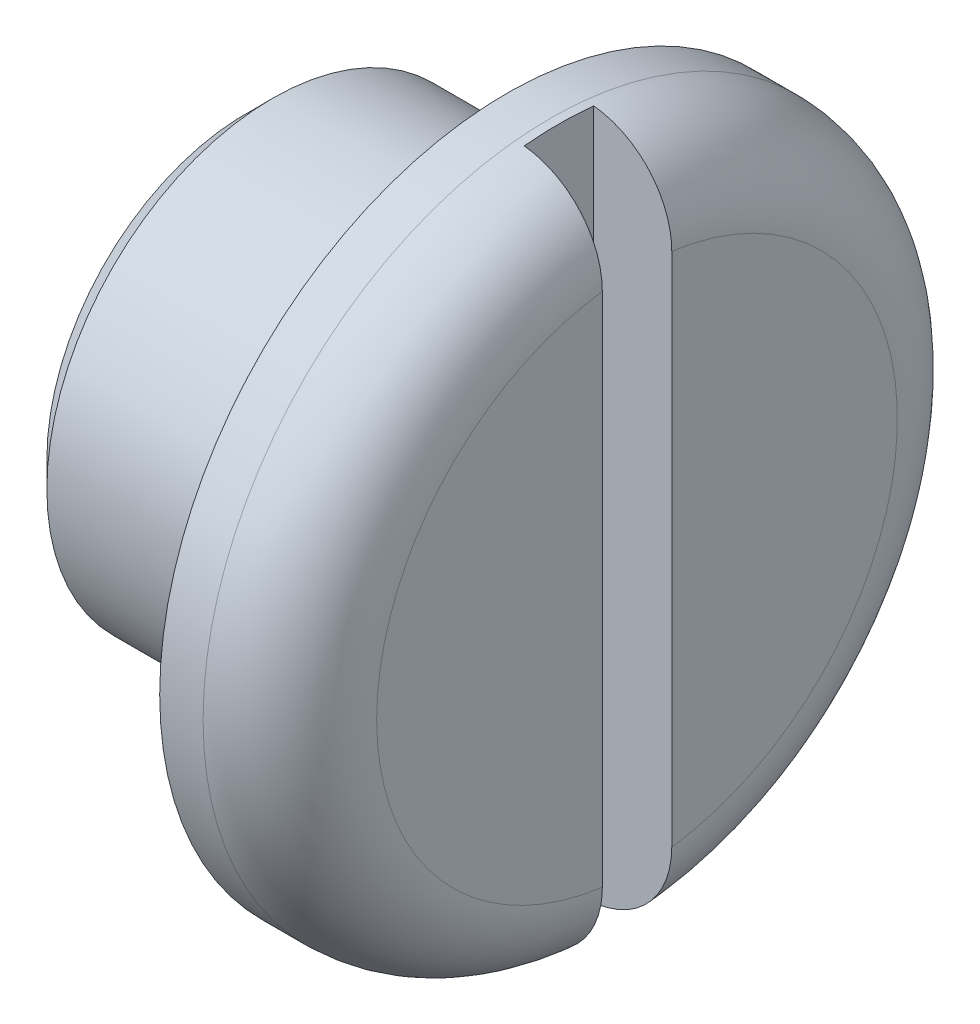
ISO-10303-21;
HEADER;
FILE_DESCRIPTION(('STEP AP214'),'2;1');
FILE_NAME('part.step','',(''),(''),'','','');
FILE_SCHEMA(('AUTOMOTIVE_DESIGN { 1 0 10303 214 1 1 1 1 }'));
ENDSEC;
DATA;
#1=APPLICATION_CONTEXT('core data for automotive mechanical design processes');
#2=APPLICATION_PROTOCOL_DEFINITION('international standard','automotive_design',2000,#1);
#3=PRODUCT_CONTEXT('',#1,'mechanical');
#4=PRODUCT('Part','Part','',(#3));
#5=PRODUCT_RELATED_PRODUCT_CATEGORY('part','',(#4));
#6=PRODUCT_DEFINITION_FORMATION('','',#4);
#7=PRODUCT_DEFINITION_CONTEXT('part definition',#1,'design');
#8=PRODUCT_DEFINITION('design','',#6,#7);
#9=PRODUCT_DEFINITION_SHAPE('','',#8);
#10=(LENGTH_UNIT() NAMED_UNIT(*) SI_UNIT(.MILLI.,.METRE.));
#11=(NAMED_UNIT(*) PLANE_ANGLE_UNIT() SI_UNIT($,.RADIAN.));
#12=(NAMED_UNIT(*) SI_UNIT($,.STERADIAN.) SOLID_ANGLE_UNIT());
#13=UNCERTAINTY_MEASURE_WITH_UNIT(LENGTH_MEASURE(1.E-05),#10,'distance_accuracy_value','');
#14=(GEOMETRIC_REPRESENTATION_CONTEXT(3) GLOBAL_UNCERTAINTY_ASSIGNED_CONTEXT((#13)) GLOBAL_UNIT_ASSIGNED_CONTEXT((#10,
#11,#12)) REPRESENTATION_CONTEXT('',''));
#15=CARTESIAN_POINT('',(0.,0.,0.));
#16=DIRECTION('',(0.,0.,1.));
#17=DIRECTION('',(1.,0.,0.));
#18=AXIS2_PLACEMENT_3D('',#15,#16,#17);
#19=CARTESIAN_POINT('',(2.25,0.,0.));
#20=DIRECTION('',(-1.,0.,0.));
#21=DIRECTION('',(0.,0.,1.));
#22=AXIS2_PLACEMENT_3D('',#19,#20,#21);
#23=PLANE('',#22);
#24=CARTESIAN_POINT('',(2.25,0.,0.));
#25=DIRECTION('',(-1.,0.,0.));
#26=DIRECTION('',(0.,0.,1.));
#27=AXIS2_PLACEMENT_3D('',#24,#25,#26);
#28=CIRCLE('',#27,1.5);
#29=CARTESIAN_POINT('',(2.25,-1.48660687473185,0.199999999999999));
#30=VERTEX_POINT('',#29);
#31=CARTESIAN_POINT('',(2.25,1.48660687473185,0.2));
#32=VERTEX_POINT('',#31);
#33=EDGE_CURVE('E82',#30,#32,#28,.T.);
#34=ORIENTED_EDGE('',*,*,#33,.F.);
#35=DIRECTION('',(0.,-1.,0.));
#36=VECTOR('',#35,1.);
#37=CARTESIAN_POINT('',(2.25,2.55009374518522,0.2));
#38=LINE('',#37,#36);
#39=EDGE_CURVE('E74',#32,#30,#38,.T.);
#40=ORIENTED_EDGE('',*,*,#39,.F.);
#41=EDGE_LOOP('',(#34,#40));
#42=FACE_BOUND('',#41,.T.);
#43=ADVANCED_FACE('F30',(#42),#23,.F.);
#44=CARTESIAN_POINT('',(0.,1.3,0.));
#45=DIRECTION('',(1.,0.,0.));
#46=DIRECTION('',(0.,0.,-1.));
#47=AXIS2_PLACEMENT_3D('',#44,#45,#46);
#48=PLANE('',#47);
#49=CARTESIAN_POINT('',(0.,0.,0.));
#50=DIRECTION('',(1.,0.,0.));
#51=DIRECTION('',(0.,0.,-1.));
#52=AXIS2_PLACEMENT_3D('',#49,#50,#51);
#53=CIRCLE('',#52,1.15);
#54=CARTESIAN_POINT('',(0.,0.,-1.15));
#55=VERTEX_POINT('',#54);
#56=EDGE_CURVE('E38',#55,#55,#53,.F.);
#57=ORIENTED_EDGE('',*,*,#56,.T.);
#58=EDGE_LOOP('',(#57));
#59=FACE_BOUND('',#58,.T.);
#60=ADVANCED_FACE('F130',(#59),#48,.F.);
#61=CARTESIAN_POINT('',(2.25,1.48660687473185,-0.2));
#62=VERTEX_POINT('',#61);
#63=CARTESIAN_POINT('',(2.25,-1.48660687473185,-0.2));
#64=VERTEX_POINT('',#63);
#65=EDGE_CURVE('E89',#62,#64,#28,.T.);
#66=ORIENTED_EDGE('',*,*,#65,.F.);
#67=DIRECTION('',(0.,1.,0.));
#68=VECTOR('',#67,1.);
#69=CARTESIAN_POINT('',(2.25,2.55009374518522,-0.2));
#70=LINE('',#69,#68);
#71=EDGE_CURVE('E83',#64,#62,#70,.T.);
#72=ORIENTED_EDGE('',*,*,#71,.F.);
#73=EDGE_LOOP('',(#66,#72));
#74=FACE_BOUND('',#73,.T.);
#75=ADVANCED_FACE('F139',(#74),#23,.F.);
#76=CARTESIAN_POINT('',(1.75,0.,0.));
#77=DIRECTION('',(-1.,0.,0.));
#78=DIRECTION('',(0.,0.,1.));
#79=AXIS2_PLACEMENT_3D('',#76,#77,#78);
#80=TOROIDAL_SURFACE('',#79,1.5,0.5);
#81=ORIENTED_EDGE('',*,*,#33,.T.);
#82=CARTESIAN_POINT('',(1.95508412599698,1.02465881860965,0.2));
#83=CARTESIAN_POINT('',(1.98079742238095,1.03644283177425,0.2));
#84=CARTESIAN_POINT('',(2.00552257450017,1.05043738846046,0.2));
#85=CARTESIAN_POINT('',(2.05228267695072,1.08240627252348,0.2));
#86=CARTESIAN_POINT('',(2.07431374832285,1.10038623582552,0.2));
#87=CARTESIAN_POINT('',(2.11503722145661,1.13975440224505,0.2));
#88=CARTESIAN_POINT('',(2.13373343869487,1.16113865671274,0.2));
#89=CARTESIAN_POINT('',(2.16730995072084,1.20670672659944,0.2));
#90=CARTESIAN_POINT('',(2.18219125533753,1.23088979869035,0.2));
#91=CARTESIAN_POINT('',(2.20788221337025,1.28165198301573,0.2));
#92=CARTESIAN_POINT('',(2.21864729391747,1.30825366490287,0.2));
#93=CARTESIAN_POINT('',(2.23558110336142,1.36288373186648,0.2));
#94=CARTESIAN_POINT('',(2.24174948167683,1.39091222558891,0.2));
#95=CARTESIAN_POINT('',(2.2493239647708,1.44772672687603,0.2));
#96=CARTESIAN_POINT('',(2.25070991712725,1.47651542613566,0.2));
#97=CARTESIAN_POINT('',(2.24860947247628,1.53391501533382,0.2));
#98=CARTESIAN_POINT('',(2.24512314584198,1.56252590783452,0.2));
#99=CARTESIAN_POINT('',(2.23338393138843,1.61863795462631,0.2));
#100=CARTESIAN_POINT('',(2.22514946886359,1.64614296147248,0.2));
#101=CARTESIAN_POINT('',(2.20414686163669,1.69936420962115,0.2));
#102=CARTESIAN_POINT('',(2.19137888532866,1.72508051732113,0.2));
#103=CARTESIAN_POINT('',(2.16176844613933,1.77379932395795,0.2));
#104=CARTESIAN_POINT('',(2.14495552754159,1.79681977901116,0.2));
#105=CARTESIAN_POINT('',(2.10767867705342,1.8396861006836,0.2));
#106=CARTESIAN_POINT('',(2.08721487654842,1.85953208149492,0.2));
#107=CARTESIAN_POINT('',(2.04337032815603,1.89534243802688,0.2));
#108=CARTESIAN_POINT('',(2.02001068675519,1.9113326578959,0.2));
#109=CARTESIAN_POINT('',(1.97092752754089,1.9391408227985,0.2));
#110=CARTESIAN_POINT('',(1.94520408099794,1.95095889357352,0.2));
#111=CARTESIAN_POINT('',(1.89226479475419,1.97002758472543,0.2));
#112=CARTESIAN_POINT('',(1.86505720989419,1.97730112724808,0.2));
#113=CARTESIAN_POINT('',(1.80980589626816,1.98716345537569,0.2));
#114=CARTESIAN_POINT('',(1.7817621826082,1.98975232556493,0.2));
#115=CARTESIAN_POINT('',(1.72571525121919,1.9901693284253,0.2));
#116=CARTESIAN_POINT('',(1.69771212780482,1.98801026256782,0.2));
#117=CARTESIAN_POINT('',(1.64246631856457,1.9790204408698,0.2));
#118=CARTESIAN_POINT('',(1.6152236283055,1.97218971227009,0.2));
#119=CARTESIAN_POINT('',(1.56227477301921,1.95405610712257,0.2));
#120=CARTESIAN_POINT('',(1.53656837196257,1.94275391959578,0.2));
#121=CARTESIAN_POINT('',(1.48741190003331,1.91600401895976,0.2));
#122=CARTESIAN_POINT('',(1.46396184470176,1.90055627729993,0.2));
#123=CARTESIAN_POINT('',(1.41992125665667,1.86591798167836,0.2));
#124=CARTESIAN_POINT('',(1.39933765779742,1.84671861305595,0.2));
#125=CARTESIAN_POINT('',(1.36166757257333,1.8051512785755,0.2));
#126=CARTESIAN_POINT('',(1.34458115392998,1.78278325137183,0.2));
#127=CARTESIAN_POINT('',(1.3143002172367,1.73540145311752,0.2));
#128=CARTESIAN_POINT('',(1.30112466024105,1.71037556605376,0.2));
#129=CARTESIAN_POINT('',(1.27913065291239,1.65847773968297,0.2));
#130=CARTESIAN_POINT('',(1.27031234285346,1.63160574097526,0.2));
#131=CARTESIAN_POINT('',(1.25721882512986,1.57658732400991,0.2));
#132=CARTESIAN_POINT('',(1.25297433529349,1.54843359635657,0.2));
#133=CARTESIAN_POINT('',(1.24923571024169,1.49181266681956,0.2));
#134=CARTESIAN_POINT('',(1.2497417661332,1.46334545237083,0.2));
#135=CARTESIAN_POINT('',(1.25549714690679,1.40668706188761,0.2));
#136=CARTESIAN_POINT('',(1.26078063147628,1.37849935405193,0.2));
#137=CARTESIAN_POINT('',(1.27598165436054,1.32340181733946,0.2));
#138=CARTESIAN_POINT('',(1.28589939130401,1.29649204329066,0.2));
#139=CARTESIAN_POINT('',(1.31014824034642,1.24458471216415,0.2));
#140=CARTESIAN_POINT('',(1.32449990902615,1.21959675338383,0.2));
#141=CARTESIAN_POINT('',(1.35720452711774,1.17239118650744,0.2));
#142=CARTESIAN_POINT('',(1.37555752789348,1.15017361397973,0.2));
#143=CARTESIAN_POINT('',(1.41570765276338,1.10921679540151,0.2));
#144=CARTESIAN_POINT('',(1.43749572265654,1.09046867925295,0.2));
#145=CARTESIAN_POINT('',(1.48394504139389,1.05695466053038,0.2));
#146=CARTESIAN_POINT('',(1.50860596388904,1.0421883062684,0.2));
#147=CARTESIAN_POINT('',(1.55975595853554,1.01727933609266,0.2));
#148=CARTESIAN_POINT('',(1.58621629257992,1.00707773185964,0.2));
#149=CARTESIAN_POINT('',(1.64049956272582,0.991350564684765,0.2));
#150=CARTESIAN_POINT('',(1.66832267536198,0.985825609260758,0.2));
#151=CARTESIAN_POINT('',(1.72401645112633,0.979697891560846,0.2));
#152=CARTESIAN_POINT('',(1.7518780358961,0.979011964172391,0.2));
#153=CARTESIAN_POINT('',(1.80729032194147,0.982367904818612,0.2));
#154=CARTESIAN_POINT('',(1.8348413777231,0.986403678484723,0.2));
#155=CARTESIAN_POINT('',(1.87786246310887,0.996472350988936,0.2));
#156=CARTESIAN_POINT('',(1.89369337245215,1.00102783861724,0.2));
#157=CARTESIAN_POINT('',(1.92482243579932,1.0116923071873,0.2));
#158=CARTESIAN_POINT('',(1.94012059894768,1.01780126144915,0.2));
#159=CARTESIAN_POINT('',(1.95508412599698,1.02465881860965,0.2));
#160=B_SPLINE_CURVE_WITH_KNOTS('',3,(#82,#83,#84,#85,#86,#87,#88,#89,#90,#91,#92,#93,#94,#95,
#96,#97,#98,#99,#100,#101,#102,#103,#104,#105,#106,#107,#108,#109,#110,#111,#112,#113,#114,#115,
#116,#117,#118,#119,#120,#121,#122,#123,#124,#125,#126,#127,#128,#129,#130,#131,#132,#133,#134,
#135,#136,#137,#138,#139,#140,#141,#142,#143,#144,#145,#146,#147,#148,#149,#150,#151,#152,#153,
#154,#155,#156,#157,#158,#159),.UNSPECIFIED.,.T.,.F.,(4,2,2,2,2,2,2,2,2,2,2,2,2,2,2,2,2,2,2,2,2,
2,2,2,2,2,2,2,2,2,2,2,2,2,2,2,2,2,4),(0.,0.0847933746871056,0.169707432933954,0.254523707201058,
0.339317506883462,0.425005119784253,0.510699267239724,0.596754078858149,0.682807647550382,
0.768529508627,0.854248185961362,0.939358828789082,1.02446640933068,1.1089866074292,
1.19350425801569,1.27759209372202,1.3616784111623,1.44553829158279,1.52939768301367,
1.61324415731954,1.69709120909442,1.78113768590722,1.86518579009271,1.94963496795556,
2.03408686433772,2.11910247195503,2.20412149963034,2.28975328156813,2.3753887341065,
2.46142732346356,2.5474670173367,2.63328360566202,2.71909045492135,2.80375395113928,
2.88842844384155,2.97164406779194,3.05475240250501,3.10409768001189,3.15344211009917),.UNSPECIFIED.);
#161=CARTESIAN_POINT('',(1.8,1.98745595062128,0.2));
#162=VERTEX_POINT('',#161);
#163=EDGE_CURVE('E71',#32,#162,#160,.T.);
#164=ORIENTED_EDGE('',*,*,#163,.T.);
#165=CARTESIAN_POINT('',(1.8,0.,0.));
#166=DIRECTION('',(1.,0.,0.));
#167=DIRECTION('',(0.,0.,-1.));
#168=AXIS2_PLACEMENT_3D('',#165,#166,#167);
#169=CIRCLE('',#168,1.99749371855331);
#170=CARTESIAN_POINT('',(1.8,1.98745595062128,-0.2));
#171=VERTEX_POINT('',#170);
#172=EDGE_CURVE('E101',#171,#162,#169,.T.);
#173=ORIENTED_EDGE('',*,*,#172,.F.);
#174=CARTESIAN_POINT('',(1.95508412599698,1.02465881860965,-0.2));
#175=CARTESIAN_POINT('',(1.92995993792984,1.01314751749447,-0.2));
#176=CARTESIAN_POINT('',(1.90385647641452,1.0037295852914,-0.2));
#177=CARTESIAN_POINT('',(1.85042057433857,0.989397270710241,-0.2));
#178=CARTESIAN_POINT('',(1.82308694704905,0.984487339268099,-0.2));
#179=CARTESIAN_POINT('',(1.76798328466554,0.97934548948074,-0.2));
#180=CARTESIAN_POINT('',(1.74021329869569,0.97911304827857,-0.2));
#181=CARTESIAN_POINT('',(1.68503865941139,0.983333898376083,-0.2));
#182=CARTESIAN_POINT('',(1.65763393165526,0.987786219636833,-0.2));
#183=CARTESIAN_POINT('',(1.60405275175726,1.00120266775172,-0.2));
#184=CARTESIAN_POINT('',(1.57787245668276,1.0101514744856,-0.2));
#185=CARTESIAN_POINT('',(1.52735886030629,1.0322672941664,-0.2));
#186=CARTESIAN_POINT('',(1.50302572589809,1.04543468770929,-0.2));
#187=CARTESIAN_POINT('',(1.45658391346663,1.07576576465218,-0.2));
#188=CARTESIAN_POINT('',(1.43450471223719,1.09297456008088,-0.2));
#189=CARTESIAN_POINT('',(1.39348462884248,1.13079539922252,-0.2));
#190=CARTESIAN_POINT('',(1.37454402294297,1.15140774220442,-0.2));
#191=CARTESIAN_POINT('',(1.33999303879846,1.19584488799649,-0.2));
#192=CARTESIAN_POINT('',(1.32444715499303,1.21971985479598,-0.2));
#193=CARTESIAN_POINT('',(1.29753567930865,1.26972004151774,-0.2));
#194=CARTESIAN_POINT('',(1.28617033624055,1.29584539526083,-0.2));
#195=CARTESIAN_POINT('',(1.26783773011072,1.34989790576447,-0.2));
#196=CARTESIAN_POINT('',(1.2609169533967,1.37784084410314,-0.2));
#197=CARTESIAN_POINT('',(1.25186299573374,1.43449243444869,-0.2));
#198=CARTESIAN_POINT('',(1.2497298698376,1.46320109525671,-0.2));
#199=CARTESIAN_POINT('',(1.25032493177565,1.52057565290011,-0.2));
#200=CARTESIAN_POINT('',(1.2530542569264,1.54924153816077,-0.2));
#201=CARTESIAN_POINT('',(1.2633154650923,1.6057009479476,-0.2));
#202=CARTESIAN_POINT('',(1.27084722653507,1.6334944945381,-0.2));
#203=CARTESIAN_POINT('',(1.29045672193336,1.68724718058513,-0.2));
#204=CARTESIAN_POINT('',(1.30250795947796,1.71321598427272,-0.2));
#205=CARTESIAN_POINT('',(1.33083031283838,1.76274069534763,-0.2));
#206=CARTESIAN_POINT('',(1.34710127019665,1.78629669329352,-0.2));
#207=CARTESIAN_POINT('',(1.3832725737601,1.83014416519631,-0.2));
#208=CARTESIAN_POINT('',(1.40314551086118,1.85045825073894,-0.2));
#209=CARTESIAN_POINT('',(1.44603867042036,1.88743589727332,-0.2));
#210=CARTESIAN_POINT('',(1.46905878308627,1.90409958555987,-0.2));
#211=CARTESIAN_POINT('',(1.51743686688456,1.93319573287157,-0.2));
#212=CARTESIAN_POINT('',(1.5427793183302,1.94565399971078,-0.2));
#213=CARTESIAN_POINT('',(1.59520204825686,1.9661189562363,-0.2));
#214=CARTESIAN_POINT('',(1.62228228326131,1.97412575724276,-0.2));
#215=CARTESIAN_POINT('',(1.67729208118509,1.98543016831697,-0.2));
#216=CARTESIAN_POINT('',(1.70521769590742,1.98874699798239,-0.2));
#217=CARTESIAN_POINT('',(1.76122882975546,1.9906368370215,-0.2));
#218=CARTESIAN_POINT('',(1.78931434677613,1.98920990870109,-0.2));
#219=CARTESIAN_POINT('',(1.84480007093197,1.98166007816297,-0.2));
#220=CARTESIAN_POINT('',(1.87220131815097,1.97554481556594,-0.2));
#221=CARTESIAN_POINT('',(1.92558957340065,1.95880485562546,-0.2));
#222=CARTESIAN_POINT('',(1.9515765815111,1.94818015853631,-0.2));
#223=CARTESIAN_POINT('',(2.0014265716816,1.92271658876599,-0.2));
#224=CARTESIAN_POINT('',(2.02528757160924,1.90787383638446,-0.2));
#225=CARTESIAN_POINT('',(2.07018972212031,1.87440584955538,-0.2));
#226=CARTESIAN_POINT('',(2.09123084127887,1.85578057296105,-0.2));
#227=CARTESIAN_POINT('',(2.12997597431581,1.81521106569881,-0.2));
#228=CARTESIAN_POINT('',(2.14766833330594,1.7932557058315,-0.2));
#229=CARTESIAN_POINT('',(2.17914015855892,1.74670035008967,-0.2));
#230=CARTESIAN_POINT('',(2.19291952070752,1.7221002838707,-0.2));
#231=CARTESIAN_POINT('',(2.21626034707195,1.67080611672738,-0.2));
#232=CARTESIAN_POINT('',(2.22579745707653,1.64410093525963,-0.2));
#233=CARTESIAN_POINT('',(2.24028803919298,1.58947499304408,-0.2));
#234=CARTESIAN_POINT('',(2.24524133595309,1.56155418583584,-0.2));
#235=CARTESIAN_POINT('',(2.25046136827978,1.50507615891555,-0.2));
#236=CARTESIAN_POINT('',(2.25069428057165,1.47651581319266,-0.2));
#237=CARTESIAN_POINT('',(2.24639552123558,1.41975695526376,-0.2));
#238=CARTESIAN_POINT('',(2.24186382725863,1.39155844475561,-0.2));
#239=CARTESIAN_POINT('',(2.22812710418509,1.33612750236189,-0.2));
#240=CARTESIAN_POINT('',(2.21889171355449,1.30890259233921,-0.2));
#241=CARTESIAN_POINT('',(2.19598935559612,1.25637553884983,-0.2));
#242=CARTESIAN_POINT('',(2.1823211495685,1.23107393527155,-0.2));
#243=CARTESIAN_POINT('',(2.15089086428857,1.18305857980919,-0.2));
#244=CARTESIAN_POINT('',(2.13311770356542,1.16035208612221,-0.2));
#245=CARTESIAN_POINT('',(2.09399922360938,1.11829205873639,-0.2));
#246=CARTESIAN_POINT('',(2.07265828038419,1.09893447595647,-0.2));
#247=CARTESIAN_POINT('',(2.0351574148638,1.07035298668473,-0.2));
#248=CARTESIAN_POINT('',(2.01986171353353,1.05997625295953,-0.2));
#249=CARTESIAN_POINT('',(1.98821774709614,1.04097449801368,-0.2));
#250=CARTESIAN_POINT('',(1.97186948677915,1.03234946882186,-0.2));
#251=CARTESIAN_POINT('',(1.95508412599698,1.02465881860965,-0.2));
#252=B_SPLINE_CURVE_WITH_KNOTS('',3,(#174,#175,#176,#177,#178,#179,#180,#181,#182,#183,#184,
#185,#186,#187,#188,#189,#190,#191,#192,#193,#194,#195,#196,#197,#198,#199,#200,#201,#202,#203,
#204,#205,#206,#207,#208,#209,#210,#211,#212,#213,#214,#215,#216,#217,#218,#219,#220,#221,#222,
#223,#224,#225,#226,#227,#228,#229,#230,#231,#232,#233,#234,#235,#236,#237,#238,#239,#240,#241,
#242,#243,#244,#245,#246,#247,#248,#249,#250,#251),.UNSPECIFIED.,.T.,.F.,(4,2,2,2,2,2,2,2,2,2,2,
2,2,2,2,2,2,2,2,2,2,2,2,2,2,2,2,2,2,2,2,2,2,2,2,2,2,2,4),(0.,0.082840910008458,
0.165763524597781,0.248676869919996,0.331573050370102,0.414188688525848,0.496811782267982,
0.580405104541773,0.664005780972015,0.749078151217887,0.834155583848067,0.920108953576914,
1.00606331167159,1.09203777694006,1.17801006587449,1.26348600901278,1.34895874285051,
1.43380647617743,1.51865125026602,1.60296545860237,1.68727755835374,1.77124313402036,
1.85520760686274,1.93903554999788,2.02286348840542,2.10676878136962,2.19067500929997,
2.27486809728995,2.3590634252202,2.44373605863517,2.52841193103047,2.6136943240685,
2.69897711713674,2.78481750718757,2.8706819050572,2.95678086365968,3.0427749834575,
3.09812088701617,3.15346653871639),.UNSPECIFIED.);
#253=EDGE_CURVE('E53',#171,#62,#252,.T.);
#254=ORIENTED_EDGE('',*,*,#253,.T.);
#255=ORIENTED_EDGE('',*,*,#65,.T.);
#256=CARTESIAN_POINT('',(2.04041542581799,-1.89649552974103,-0.2));
#257=CARTESIAN_POINT('',(2.01767005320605,-1.91281353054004,-0.2));
#258=CARTESIAN_POINT('',(1.99353402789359,-1.92722712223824,-0.200000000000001));
#259=CARTESIAN_POINT('',(1.94316573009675,-1.95181106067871,-0.200000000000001));
#260=CARTESIAN_POINT('',(1.91693107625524,-1.96197650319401,-0.200000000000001));
#261=CARTESIAN_POINT('',(1.8631333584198,-1.97775078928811,-0.200000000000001));
#262=CARTESIAN_POINT('',(1.83557077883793,-1.98336128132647,-0.200000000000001));
#263=CARTESIAN_POINT('',(1.77990179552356,-1.98986537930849,-0.200000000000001));
#264=CARTESIAN_POINT('',(1.75179552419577,-1.9907601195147,-0.200000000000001));
#265=CARTESIAN_POINT('',(1.6958732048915,-1.98781250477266,-0.200000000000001));
#266=CARTESIAN_POINT('',(1.66805679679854,-1.98397698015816,-0.200000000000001));
#267=CARTESIAN_POINT('',(1.61346167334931,-1.971691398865,-0.200000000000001));
#268=CARTESIAN_POINT('',(1.58668299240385,-1.96324118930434,-0.200000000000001));
#269=CARTESIAN_POINT('',(1.53491438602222,-1.94196790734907,-0.200000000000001));
#270=CARTESIAN_POINT('',(1.50992496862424,-1.92914359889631,-0.2));
#271=CARTESIAN_POINT('',(1.46244600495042,-1.89949284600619,-0.2));
#272=CARTESIAN_POINT('',(1.43995647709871,-1.88266637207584,-0.2));
#273=CARTESIAN_POINT('',(1.39804482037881,-1.84544141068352,-0.2));
#274=CARTESIAN_POINT('',(1.37863152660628,-1.82503297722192,-0.2));
#275=CARTESIAN_POINT('',(1.3434859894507,-1.78126116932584,-0.2));
#276=CARTESIAN_POINT('',(1.32775381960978,-1.75789773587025,-0.2));
#277=CARTESIAN_POINT('',(1.3003272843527,-1.70875187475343,-0.2));
#278=CARTESIAN_POINT('',(1.28865418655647,-1.68295758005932,-0.2));
#279=CARTESIAN_POINT('',(1.26977097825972,-1.62978447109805,-0.2));
#280=CARTESIAN_POINT('',(1.26256102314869,-1.60240560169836,-0.2));
#281=CARTESIAN_POINT('',(1.25275473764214,-1.54663883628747,-0.2));
#282=CARTESIAN_POINT('',(1.25019061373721,-1.51824527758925,-0.2));
#283=CARTESIAN_POINT('',(1.24982987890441,-1.46142796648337,-0.2));
#284=CARTESIAN_POINT('',(1.25203346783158,-1.43300421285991,-0.2));
#285=CARTESIAN_POINT('',(1.26116681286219,-1.37672054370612,-0.2));
#286=CARTESIAN_POINT('',(1.26812975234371,-1.34886601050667,-0.2));
#287=CARTESIAN_POINT('',(1.28661463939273,-1.29471236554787,-0.2));
#288=CARTESIAN_POINT('',(1.29813676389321,-1.26841331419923,-0.2));
#289=CARTESIAN_POINT('',(1.32547184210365,-1.21801801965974,-0.2));
#290=CARTESIAN_POINT('',(1.34130089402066,-1.19393050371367,-0.2));
#291=CARTESIAN_POINT('',(1.37679456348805,-1.1487679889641,-0.2));
#292=CARTESIAN_POINT('',(1.39645918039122,-1.12769298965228,-0.2));
#293=CARTESIAN_POINT('',(1.4389870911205,-1.08927011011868,-0.2));
#294=CARTESIAN_POINT('',(1.46183588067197,-1.07190618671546,-0.2));
#295=CARTESIAN_POINT('',(1.5101603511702,-1.04132826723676,-0.2));
#296=CARTESIAN_POINT('',(1.53563579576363,-1.02811389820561,-0.2));
#297=CARTESIAN_POINT('',(1.58808951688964,-1.00642979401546,-0.2));
#298=CARTESIAN_POINT('',(1.61503986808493,-0.997892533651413,-0.2));
#299=CARTESIAN_POINT('',(1.67000277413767,-0.985552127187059,-0.2));
#300=CARTESIAN_POINT('',(1.69801519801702,-0.981748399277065,-0.2));
#301=CARTESIAN_POINT('',(1.75379899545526,-0.979028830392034,-0.2));
#302=CARTESIAN_POINT('',(1.78156641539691,-0.980031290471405,-0.2));
#303=CARTESIAN_POINT('',(1.83653378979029,-0.986702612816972,-0.2));
#304=CARTESIAN_POINT('',(1.86373375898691,-0.992371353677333,-0.2));
#305=CARTESIAN_POINT('',(1.91670532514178,-1.00815931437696,-0.2));
#306=CARTESIAN_POINT('',(1.94248151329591,-1.0182631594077,-0.2));
#307=CARTESIAN_POINT('',(1.99200462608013,-1.04259847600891,-0.2));
#308=CARTESIAN_POINT('',(2.01575141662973,-1.05683022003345,-0.2));
#309=CARTESIAN_POINT('',(2.06088955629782,-1.08921237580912,-0.2));
#310=CARTESIAN_POINT('',(2.08224492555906,-1.1074129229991,-0.2));
#311=CARTESIAN_POINT('',(2.12166254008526,-1.14708572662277,-0.2));
#312=CARTESIAN_POINT('',(2.13972448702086,-1.1685582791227,-0.2));
#313=CARTESIAN_POINT('',(2.17236159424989,-1.21456767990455,-0.2));
#314=CARTESIAN_POINT('',(2.1868714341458,-1.23915088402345,-0.2));
#315=CARTESIAN_POINT('',(2.21160109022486,-1.29038832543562,-0.2));
#316=CARTESIAN_POINT('',(2.22182066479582,-1.31704267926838,-0.2));
#317=CARTESIAN_POINT('',(2.2377569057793,-1.37192451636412,-0.2));
#318=CARTESIAN_POINT('',(2.24343260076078,-1.40016390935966,-0.2));
#319=CARTESIAN_POINT('',(2.24995836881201,-1.45719433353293,-0.2));
#320=CARTESIAN_POINT('',(2.25080860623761,-1.4859853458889,-0.2));
#321=CARTESIAN_POINT('',(2.24764715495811,-1.54327228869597,-0.2));
#322=CARTESIAN_POINT('',(2.24364010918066,-1.57176847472,-0.2));
#323=CARTESIAN_POINT('',(2.23086670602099,-1.62768208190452,-0.2));
#324=CARTESIAN_POINT('',(2.22209929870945,-1.65509926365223,-0.2));
#325=CARTESIAN_POINT('',(2.20010622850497,-1.70789608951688,-0.2));
#326=CARTESIAN_POINT('',(2.18690635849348,-1.73328649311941,-0.2));
#327=CARTESIAN_POINT('',(2.15640887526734,-1.78144461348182,-0.2));
#328=CARTESIAN_POINT('',(2.13911638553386,-1.80421555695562,-0.2));
#329=CARTESIAN_POINT('',(2.10807866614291,-1.83857773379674,-0.2));
#330=CARTESIAN_POINT('',(2.09542069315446,-1.85116810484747,-0.2));
#331=CARTESIAN_POINT('',(2.06883513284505,-1.87492852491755,-0.2));
#332=CARTESIAN_POINT('',(2.05490755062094,-1.88609857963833,-0.2));
#333=CARTESIAN_POINT('',(2.04041542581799,-1.89649552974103,-0.2));
#334=B_SPLINE_CURVE_WITH_KNOTS('',3,(#256,#257,#258,#259,#260,#261,#262,#263,#264,#265,#266,
#267,#268,#269,#270,#271,#272,#273,#274,#275,#276,#277,#278,#279,#280,#281,#282,#283,#284,#285,
#286,#287,#288,#289,#290,#291,#292,#293,#294,#295,#296,#297,#298,#299,#300,#301,#302,#303,#304,
#305,#306,#307,#308,#309,#310,#311,#312,#313,#314,#315,#316,#317,#318,#319,#320,#321,#322,#323,
#324,#325,#326,#327,#328,#329,#330,#331,#332,#333),.UNSPECIFIED.,.T.,.F.,(4,2,2,2,2,2,2,2,2,2,2,
2,2,2,2,2,2,2,2,2,2,2,2,2,2,2,2,2,2,2,2,2,2,2,2,2,2,2,4),(0.,0.0839152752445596,
0.16792715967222,0.251908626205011,0.335869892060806,0.419710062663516,0.503553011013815,
0.587419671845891,0.671286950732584,0.755390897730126,0.839496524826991,0.924036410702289,
1.00857923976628,1.09370593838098,1.17883620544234,1.26456615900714,1.3502994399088,
1.4363576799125,1.52241590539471,1.60809421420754,1.69376482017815,1.7781635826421,
1.86255197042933,1.94551100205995,2.0284678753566,2.11113941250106,2.19381640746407,
2.2776054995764,2.36140217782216,2.44664024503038,2.53188311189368,2.61788620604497,
2.70388637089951,2.78980439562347,2.87574137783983,2.96118670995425,3.04652563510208,
3.0999921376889,3.15345842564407),.UNSPECIFIED.);
#335=CARTESIAN_POINT('',(1.8,-1.98745595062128,-0.200000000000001));
#336=VERTEX_POINT('',#335);
#337=EDGE_CURVE('E100',#64,#336,#334,.T.);
#338=ORIENTED_EDGE('',*,*,#337,.T.);
#339=CARTESIAN_POINT('',(1.8,-1.98745595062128,0.199999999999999));
#340=VERTEX_POINT('',#339);
#341=EDGE_CURVE('E93',#340,#336,#169,.T.);
#342=ORIENTED_EDGE('',*,*,#341,.F.);
#343=CARTESIAN_POINT('',(2.04041542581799,-1.89649552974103,0.199999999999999));
#344=CARTESIAN_POINT('',(2.06331710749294,-1.88006227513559,0.199999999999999));
#345=CARTESIAN_POINT('',(2.08484214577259,-1.86167399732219,0.199999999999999));
#346=CARTESIAN_POINT('',(2.124510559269,-1.82152311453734,0.199999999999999));
#347=CARTESIAN_POINT('',(2.14264962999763,-1.79975627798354,0.199999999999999));
#348=CARTESIAN_POINT('',(2.17500860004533,-1.7535040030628,0.199999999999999));
#349=CARTESIAN_POINT('',(2.1892314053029,-1.72902059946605,0.199999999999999));
#350=CARTESIAN_POINT('',(2.21338275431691,-1.67802959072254,0.199999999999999));
#351=CARTESIAN_POINT('',(2.22331235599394,-1.65152248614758,0.199999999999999));
#352=CARTESIAN_POINT('',(2.23865966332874,-1.59709231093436,0.199999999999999));
#353=CARTESIAN_POINT('',(2.24405495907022,-1.56916292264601,0.199999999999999));
#354=CARTESIAN_POINT('',(2.25011691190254,-1.51279468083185,0.199999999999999));
#355=CARTESIAN_POINT('',(2.25078319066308,-1.48435578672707,0.199999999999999));
#356=CARTESIAN_POINT('',(2.24737031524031,-1.42755701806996,0.199999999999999));
#357=CARTESIAN_POINT('',(2.24325671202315,-1.39919921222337,0.199999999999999));
#358=CARTESIAN_POINT('',(2.23035316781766,-1.34356786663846,0.199999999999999));
#359=CARTESIAN_POINT('',(2.22156303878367,-1.31629437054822,0.2));
#360=CARTESIAN_POINT('',(2.19949660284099,-1.26345750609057,0.2));
#361=CARTESIAN_POINT('',(2.18619697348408,-1.23790387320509,0.2));
#362=CARTESIAN_POINT('',(2.15549116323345,-1.18939448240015,0.2));
#363=CARTESIAN_POINT('',(2.13808491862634,-1.16643876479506,0.2));
#364=CARTESIAN_POINT('',(2.09967189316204,-1.12382659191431,0.2));
#365=CARTESIAN_POINT('',(2.07867033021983,-1.10416543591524,0.2));
#366=CARTESIAN_POINT('',(2.03362991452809,-1.06869821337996,0.2));
#367=CARTESIAN_POINT('',(2.00959124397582,-1.05289191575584,0.2));
#368=CARTESIAN_POINT('',(1.95945941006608,-1.02580084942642,0.2));
#369=CARTESIAN_POINT('',(1.93339430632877,-1.01446418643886,0.2));
#370=CARTESIAN_POINT('',(1.87970876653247,-0.996419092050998,0.2));
#371=CARTESIAN_POINT('',(1.85208853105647,-0.989710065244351,0.2));
#372=CARTESIAN_POINT('',(1.79660801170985,-0.981226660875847,0.2));
#373=CARTESIAN_POINT('',(1.76876090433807,-0.979365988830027,0.2));
#374=CARTESIAN_POINT('',(1.71315545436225,-0.980392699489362,0.2));
#375=CARTESIAN_POINT('',(1.68539710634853,-0.983279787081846,0.2));
#376=CARTESIAN_POINT('',(1.63101000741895,-0.993657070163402,0.2));
#377=CARTESIAN_POINT('',(1.6043734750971,-1.00110660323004,0.2));
#378=CARTESIAN_POINT('',(1.55271111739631,-1.02033132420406,0.2));
#379=CARTESIAN_POINT('',(1.5276853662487,-1.03210671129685,0.2));
#380=CARTESIAN_POINT('',(1.47969675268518,-1.05974727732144,0.2));
#381=CARTESIAN_POINT('',(1.45675512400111,-1.07564929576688,0.2));
#382=CARTESIAN_POINT('',(1.41380626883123,-1.11101614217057,0.2));
#383=CARTESIAN_POINT('',(1.39379930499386,-1.13048128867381,0.2));
#384=CARTESIAN_POINT('',(1.35691561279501,-1.17279583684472,0.2));
#385=CARTESIAN_POINT('',(1.34010074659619,-1.19569917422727,0.2));
#386=CARTESIAN_POINT('',(1.31049990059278,-1.24397639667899,0.2));
#387=CARTESIAN_POINT('',(1.29771419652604,-1.26935045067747,0.2));
#388=CARTESIAN_POINT('',(1.27639036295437,-1.32218145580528,0.2));
#389=CARTESIAN_POINT('',(1.26790512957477,-1.34965977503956,0.199999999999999));
#390=CARTESIAN_POINT('',(1.25565873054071,-1.40565022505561,0.199999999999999));
#391=CARTESIAN_POINT('',(1.25189765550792,-1.43416237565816,0.199999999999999));
#392=CARTESIAN_POINT('',(1.24921478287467,-1.49146415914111,0.199999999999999));
#393=CARTESIAN_POINT('',(1.25030140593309,-1.52025418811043,0.199999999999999));
#394=CARTESIAN_POINT('',(1.25731834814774,-1.57723827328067,0.199999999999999));
#395=CARTESIAN_POINT('',(1.26324856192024,-1.60543234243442,0.199999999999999));
#396=CARTESIAN_POINT('',(1.27975705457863,-1.66026829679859,0.199999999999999));
#397=CARTESIAN_POINT('',(1.29031141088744,-1.68691738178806,0.199999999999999));
#398=CARTESIAN_POINT('',(1.31577655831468,-1.73804625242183,0.199999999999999));
#399=CARTESIAN_POINT('',(1.33068719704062,-1.76252611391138,0.199999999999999));
#400=CARTESIAN_POINT('',(1.36432449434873,-1.80843147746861,0.199999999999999));
#401=CARTESIAN_POINT('',(1.38302254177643,-1.82987794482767,0.199999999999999));
#402=CARTESIAN_POINT('',(1.42377516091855,-1.86930155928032,0.199999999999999));
#403=CARTESIAN_POINT('',(1.44582961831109,-1.88727882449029,0.199999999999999));
#404=CARTESIAN_POINT('',(1.49251307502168,-1.91913169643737,0.199999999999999));
#405=CARTESIAN_POINT('',(1.51712435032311,-1.93303328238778,0.199999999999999));
#406=CARTESIAN_POINT('',(1.56833833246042,-1.95648502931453,0.199999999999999));
#407=CARTESIAN_POINT('',(1.59494090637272,-1.96603548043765,0.199999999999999));
#408=CARTESIAN_POINT('',(1.64925081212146,-1.9804727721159,0.199999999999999));
#409=CARTESIAN_POINT('',(1.67695248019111,-1.98538092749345,0.199999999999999));
#410=CARTESIAN_POINT('',(1.73279430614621,-1.9904670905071,0.199999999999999));
#411=CARTESIAN_POINT('',(1.76093456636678,-1.9906439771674,0.199999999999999));
#412=CARTESIAN_POINT('',(1.81679683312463,-1.98626485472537,0.199999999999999));
#413=CARTESIAN_POINT('',(1.84451942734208,-1.98171628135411,0.199999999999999));
#414=CARTESIAN_POINT('',(1.89878320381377,-1.96803135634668,0.199999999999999));
#415=CARTESIAN_POINT('',(1.92532578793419,-1.95890061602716,0.199999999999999));
#416=CARTESIAN_POINT('',(1.96665174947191,-1.94067478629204,0.199999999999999));
#417=CARTESIAN_POINT('',(1.98203700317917,-1.93291222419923,0.199999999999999));
#418=CARTESIAN_POINT('',(2.01192451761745,-1.91584141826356,0.199999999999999));
#419=CARTESIAN_POINT('',(2.02642677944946,-1.90653317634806,0.199999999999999));
#420=CARTESIAN_POINT('',(2.04041542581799,-1.89649552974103,0.199999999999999));
#421=B_SPLINE_CURVE_WITH_KNOTS('',3,(#343,#344,#345,#346,#347,#348,#349,#350,#351,#352,#353,
#354,#355,#356,#357,#358,#359,#360,#361,#362,#363,#364,#365,#366,#367,#368,#369,#370,#371,#372,
#373,#374,#375,#376,#377,#378,#379,#380,#381,#382,#383,#384,#385,#386,#387,#388,#389,#390,#391,
#392,#393,#394,#395,#396,#397,#398,#399,#400,#401,#402,#403,#404,#405,#406,#407,#408,#409,#410,
#411,#412,#413,#414,#415,#416,#417,#418,#419,#420),.UNSPECIFIED.,.T.,.F.,(4,2,2,2,2,2,2,2,2,2,2,
2,2,2,2,2,2,2,2,2,2,2,2,2,2,2,2,2,2,2,2,2,2,2,2,2,2,2,4),(0.,0.0844993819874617,
0.169105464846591,0.253648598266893,0.338170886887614,0.423108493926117,0.508052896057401,
0.593613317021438,0.67917717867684,0.76519048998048,0.85120513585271,0.937095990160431,
1.02298169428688,1.10783859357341,1.19268457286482,1.2760097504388,1.3593297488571,
1.4419177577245,1.52450956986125,1.60786570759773,1.69122930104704,1.77607253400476,
1.86092157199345,1.94679036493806,2.03266080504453,2.11868046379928,2.20469825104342,
2.29027619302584,2.3758511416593,2.46080224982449,2.54575046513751,2.63014480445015,
2.71453351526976,2.79853285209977,2.88255209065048,2.96643932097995,3.0502240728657,
3.10183746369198,3.15345079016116),.UNSPECIFIED.);
#422=EDGE_CURVE('E88',#340,#30,#421,.T.);
#423=ORIENTED_EDGE('',*,*,#422,.T.);
#424=EDGE_LOOP('',(#81,#164,#173,#254,#255,#338,#342,#423));
#425=FACE_BOUND('',#424,.T.);
#426=CARTESIAN_POINT('',(1.75,0.,0.));
#427=DIRECTION('',(-1.,0.,0.));
#428=DIRECTION('',(0.,0.,1.));
#429=AXIS2_PLACEMENT_3D('',#426,#427,#428);
#430=CIRCLE('',#429,2.);
#431=CARTESIAN_POINT('',(1.75,0.,2.));
#432=VERTEX_POINT('',#431);
#433=EDGE_CURVE('E90',#432,#432,#430,.T.);
#434=ORIENTED_EDGE('',*,*,#433,.F.);
#435=EDGE_LOOP('',(#434));
#436=FACE_BOUND('',#435,.T.);
#437=ADVANCED_FACE('F85',(#425,#436),#80,.T.);
#438=CARTESIAN_POINT('',(0.,0.,0.));
#439=DIRECTION('',(-1.,0.,0.));
#440=DIRECTION('',(0.,0.,1.));
#441=AXIS2_PLACEMENT_3D('',#438,#439,#440);
#442=CYLINDRICAL_SURFACE('',#441,2.);
#443=CARTESIAN_POINT('',(1.5,0.,0.));
#444=DIRECTION('',(-1.,0.,0.));
#445=DIRECTION('',(0.,0.,1.));
#446=AXIS2_PLACEMENT_3D('',#443,#444,#445);
#447=CIRCLE('',#446,2.);
#448=CARTESIAN_POINT('',(1.5,0.,2.));
#449=VERTEX_POINT('',#448);
#450=EDGE_CURVE('E95',#449,#449,#447,.T.);
#451=ORIENTED_EDGE('',*,*,#450,.F.);
#452=EDGE_LOOP('',(#451));
#453=FACE_BOUND('',#452,.T.);
#454=ORIENTED_EDGE('',*,*,#433,.T.);
#455=EDGE_LOOP('',(#454));
#456=FACE_BOUND('',#455,.T.);
#457=ADVANCED_FACE('F148',(#453,#456),#442,.T.);
#458=CARTESIAN_POINT('',(1.5,2.,0.));
#459=DIRECTION('',(1.,0.,0.));
#460=DIRECTION('',(0.,0.,-1.));
#461=AXIS2_PLACEMENT_3D('',#458,#459,#460);
#462=PLANE('',#461);
#463=CARTESIAN_POINT('',(1.5,0.,0.));
#464=DIRECTION('',(-1.,0.,0.));
#465=DIRECTION('',(0.,0.,1.));
#466=AXIS2_PLACEMENT_3D('',#463,#464,#465);
#467=CIRCLE('',#466,1.3);
#468=CARTESIAN_POINT('',(1.5,0.,1.3));
#469=VERTEX_POINT('',#468);
#470=EDGE_CURVE('E152',#469,#469,#467,.T.);
#471=ORIENTED_EDGE('',*,*,#470,.F.);
#472=EDGE_LOOP('',(#471));
#473=FACE_BOUND('',#472,.T.);
#474=ORIENTED_EDGE('',*,*,#450,.T.);
#475=EDGE_LOOP('',(#474));
#476=FACE_BOUND('',#475,.T.);
#477=ADVANCED_FACE('F161',(#473,#476),#462,.F.);
#478=CARTESIAN_POINT('',(0.,0.,0.));
#479=DIRECTION('',(-1.,0.,0.));
#480=DIRECTION('',(0.,0.,1.));
#481=AXIS2_PLACEMENT_3D('',#478,#479,#480);
#482=CYLINDRICAL_SURFACE('',#481,1.3);
#483=CARTESIAN_POINT('',(0.150000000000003,0.,0.));
#484=DIRECTION('',(1.,0.,0.));
#485=DIRECTION('',(0.,0.,-1.));
#486=AXIS2_PLACEMENT_3D('',#483,#484,#485);
#487=CIRCLE('',#486,1.3);
#488=CARTESIAN_POINT('',(0.150000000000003,0.,-1.3));
#489=VERTEX_POINT('',#488);
#490=EDGE_CURVE('E11',#489,#489,#487,.T.);
#491=ORIENTED_EDGE('',*,*,#490,.T.);
#492=EDGE_LOOP('',(#491));
#493=FACE_BOUND('',#492,.T.);
#494=ORIENTED_EDGE('',*,*,#470,.T.);
#495=EDGE_LOOP('',(#494));
#496=FACE_BOUND('',#495,.T.);
#497=ADVANCED_FACE('F169',(#493,#496),#482,.T.);
#498=CARTESIAN_POINT('',(1.8,2.55009374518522,0.2));
#499=DIRECTION('',(0.,0.,1.));
#500=DIRECTION('',(0.,-1.,0.));
#501=AXIS2_PLACEMENT_3D('',#498,#499,#500);
#502=PLANE('',#501);
#503=DIRECTION('',(0.,-1.,0.));
#504=VECTOR('',#503,1.);
#505=CARTESIAN_POINT('',(1.8,2.55009374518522,0.2));
#506=LINE('',#505,#504);
#507=EDGE_CURVE('E45',#162,#340,#506,.T.);
#508=ORIENTED_EDGE('',*,*,#507,.F.);
#509=ORIENTED_EDGE('',*,*,#163,.F.);
#510=ORIENTED_EDGE('',*,*,#39,.T.);
#511=ORIENTED_EDGE('',*,*,#422,.F.);
#512=EDGE_LOOP('',(#508,#509,#510,#511));
#513=FACE_BOUND('',#512,.T.);
#514=ADVANCED_FACE('F73',(#513),#502,.F.);
#515=CARTESIAN_POINT('',(1.8,2.55009374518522,-0.2));
#516=DIRECTION('',(0.,0.,-1.));
#517=DIRECTION('',(0.,1.,0.));
#518=AXIS2_PLACEMENT_3D('',#515,#516,#517);
#519=PLANE('',#518);
#520=ORIENTED_EDGE('',*,*,#71,.T.);
#521=ORIENTED_EDGE('',*,*,#253,.F.);
#522=DIRECTION('',(0.,1.,0.));
#523=VECTOR('',#522,1.);
#524=CARTESIAN_POINT('',(1.8,2.55009374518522,-0.2));
#525=LINE('',#524,#523);
#526=EDGE_CURVE('E151',#336,#171,#525,.T.);
#527=ORIENTED_EDGE('',*,*,#526,.F.);
#528=ORIENTED_EDGE('',*,*,#337,.F.);
#529=EDGE_LOOP('',(#520,#521,#527,#528));
#530=FACE_BOUND('',#529,.T.);
#531=ADVANCED_FACE('F115',(#530),#519,.F.);
#532=CARTESIAN_POINT('',(1.8,2.55009374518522,0.2));
#533=DIRECTION('',(1.,0.,0.));
#534=DIRECTION('',(0.,0.,-1.));
#535=AXIS2_PLACEMENT_3D('',#532,#533,#534);
#536=PLANE('',#535);
#537=ORIENTED_EDGE('',*,*,#172,.T.);
#538=ORIENTED_EDGE('',*,*,#507,.T.);
#539=ORIENTED_EDGE('',*,*,#341,.T.);
#540=ORIENTED_EDGE('',*,*,#526,.T.);
#541=EDGE_LOOP('',(#537,#538,#539,#540));
#542=FACE_BOUND('',#541,.T.);
#543=ADVANCED_FACE('F119',(#542),#536,.T.);
#544=CARTESIAN_POINT('',(0.,0.,0.));
#545=DIRECTION('',(1.,0.,0.));
#546=DIRECTION('',(0.,0.,-1.));
#547=AXIS2_PLACEMENT_3D('',#544,#545,#546);
#548=CONICAL_SURFACE('',#547,1.15,0.785398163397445);
#549=CARTESIAN_POINT('',(0.150000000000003,0.,-1.3));
#550=CARTESIAN_POINT('',(0.148437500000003,0.,-1.2984375));
#551=CARTESIAN_POINT('',(0.146875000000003,0.,-1.296875));
#552=CARTESIAN_POINT('',(0.143750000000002,0.,-1.29375));
#553=CARTESIAN_POINT('',(0.142187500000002,0.,-1.2921875));
#554=CARTESIAN_POINT('',(0.139062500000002,0.,-1.2890625));
#555=CARTESIAN_POINT('',(0.137500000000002,0.,-1.2875));
#556=CARTESIAN_POINT('',(0.134375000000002,0.,-1.284375));
#557=CARTESIAN_POINT('',(0.132812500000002,0.,-1.2828125));
#558=CARTESIAN_POINT('',(0.129687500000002,0.,-1.2796875));
#559=CARTESIAN_POINT('',(0.128125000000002,0.,-1.278125));
#560=CARTESIAN_POINT('',(0.125000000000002,0.,-1.275));
#561=CARTESIAN_POINT('',(0.123437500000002,0.,-1.2734375));
#562=CARTESIAN_POINT('',(0.120312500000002,0.,-1.2703125));
#563=CARTESIAN_POINT('',(0.118750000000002,0.,-1.26875));
#564=CARTESIAN_POINT('',(0.115625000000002,0.,-1.265625));
#565=CARTESIAN_POINT('',(0.114062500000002,0.,-1.2640625));
#566=CARTESIAN_POINT('',(0.110937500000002,0.,-1.2609375));
#567=CARTESIAN_POINT('',(0.109375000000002,0.,-1.259375));
#568=CARTESIAN_POINT('',(0.106250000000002,0.,-1.25625));
#569=CARTESIAN_POINT('',(0.104687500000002,0.,-1.2546875));
#570=CARTESIAN_POINT('',(0.101562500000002,0.,-1.2515625));
#571=CARTESIAN_POINT('',(0.100000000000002,0.,-1.25));
#572=CARTESIAN_POINT('',(0.0968750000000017,0.,-1.246875));
#573=CARTESIAN_POINT('',(0.0953125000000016,0.,-1.2453125));
#574=CARTESIAN_POINT('',(0.0921875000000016,0.,-1.2421875));
#575=CARTESIAN_POINT('',(0.0906250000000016,0.,-1.240625));
#576=CARTESIAN_POINT('',(0.0875000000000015,0.,-1.2375));
#577=CARTESIAN_POINT('',(0.0859375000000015,0.,-1.2359375));
#578=CARTESIAN_POINT('',(0.0828125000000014,0.,-1.2328125));
#579=CARTESIAN_POINT('',(0.0812500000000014,0.,-1.23125));
#580=CARTESIAN_POINT('',(0.0781250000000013,0.,-1.228125));
#581=CARTESIAN_POINT('',(0.0765625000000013,0.,-1.2265625));
#582=CARTESIAN_POINT('',(0.0734375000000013,0.,-1.2234375));
#583=CARTESIAN_POINT('',(0.0718750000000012,0.,-1.221875));
#584=CARTESIAN_POINT('',(0.0687500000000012,0.,-1.21875));
#585=CARTESIAN_POINT('',(0.0671875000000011,0.,-1.2171875));
#586=CARTESIAN_POINT('',(0.0640625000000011,0.,-1.2140625));
#587=CARTESIAN_POINT('',(0.0625000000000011,0.,-1.2125));
#588=CARTESIAN_POINT('',(0.0593750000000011,0.,-1.209375));
#589=CARTESIAN_POINT('',(0.057812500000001,0.,-1.2078125));
#590=CARTESIAN_POINT('',(0.0546875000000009,0.,-1.2046875));
#591=CARTESIAN_POINT('',(0.0531250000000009,0.,-1.203125));
#592=CARTESIAN_POINT('',(0.0500000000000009,0.,-1.2));
#593=CARTESIAN_POINT('',(0.0484375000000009,0.,-1.1984375));
#594=CARTESIAN_POINT('',(0.0453125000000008,0.,-1.1953125));
#595=CARTESIAN_POINT('',(0.0437500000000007,0.,-1.19375));
#596=CARTESIAN_POINT('',(0.0406250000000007,0.,-1.190625));
#597=CARTESIAN_POINT('',(0.0390625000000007,0.,-1.1890625));
#598=CARTESIAN_POINT('',(0.0359375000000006,0.,-1.1859375));
#599=CARTESIAN_POINT('',(0.0343750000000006,0.,-1.184375));
#600=CARTESIAN_POINT('',(0.0312500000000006,0.,-1.18125));
#601=CARTESIAN_POINT('',(0.0296875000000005,0.,-1.1796875));
#602=CARTESIAN_POINT('',(0.0265625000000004,0.,-1.1765625));
#603=CARTESIAN_POINT('',(0.0250000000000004,0.,-1.175));
#604=CARTESIAN_POINT('',(0.0218750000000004,0.,-1.171875));
#605=CARTESIAN_POINT('',(0.0203125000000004,0.,-1.1703125));
#606=CARTESIAN_POINT('',(0.0171875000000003,0.,-1.1671875));
#607=CARTESIAN_POINT('',(0.0156250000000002,0.,-1.165625));
#608=CARTESIAN_POINT('',(0.0125000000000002,0.,-1.1625));
#609=CARTESIAN_POINT('',(0.0109375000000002,0.,-1.1609375));
#610=CARTESIAN_POINT('',(0.00781250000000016,0.,-1.1578125));
#611=CARTESIAN_POINT('',(0.00625000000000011,0.,-1.15625));
#612=CARTESIAN_POINT('',(0.00312500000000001,0.,-1.153125));
#613=CARTESIAN_POINT('',(0.00156249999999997,0.,-1.1515625));
#614=CARTESIAN_POINT('',(0.,0.,-1.15));
#615=B_SPLINE_CURVE_WITH_KNOTS('',3,(#549,#550,#551,#552,#553,#554,#555,#556,#557,#558,#559,
#560,#561,#562,#563,#564,#565,#566,#567,#568,#569,#570,#571,#572,#573,#574,#575,#576,#577,#578,
#579,#580,#581,#582,#583,#584,#585,#586,#587,#588,#589,#590,#591,#592,#593,#594,#595,#596,#597,
#598,#599,#600,#601,#602,#603,#604,#605,#606,#607,#608,#609,#610,#611,#612,#613,#614),
.UNSPECIFIED.,.F.,.F.,(4,2,2,2,2,2,2,2,2,2,2,2,2,2,2,2,2,2,2,2,2,2,2,2,2,2,2,2,2,2,2,2,4),(0.,
0.00662912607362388,0.0132582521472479,0.0198873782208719,0.0265165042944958,0.0331456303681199,
0.0397747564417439,0.0464038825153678,0.0530330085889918,0.0596621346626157,0.0662912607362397,
0.0729203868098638,0.0795495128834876,0.0861786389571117,0.0928077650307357,0.0994368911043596,
0.106066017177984,0.112695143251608,0.119324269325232,0.125953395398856,0.132582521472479,
0.139211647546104,0.145840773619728,0.152469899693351,0.159099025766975,0.165728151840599,
0.172357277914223,0.178986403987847,0.185615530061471,0.192244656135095,0.198873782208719,
0.205502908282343,0.212132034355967),.UNSPECIFIED.);
#616=EDGE_CURVE('BSEAM32',#489,#55,#615,.T.);
#617=ORIENTED_EDGE('',*,*,#490,.F.);
#618=ORIENTED_EDGE('',*,*,#56,.F.);
#619=ORIENTED_EDGE('',*,*,#616,.T.);
#620=ORIENTED_EDGE('',*,*,#616,.F.);
#621=EDGE_LOOP('',(#617,#619,#618,#620));
#622=FACE_BOUND('',#621,.T.);
#623=ADVANCED_FACE('F32',(#622),#548,.T.);
#624=CLOSED_SHELL('',(#43,#60,#75,#437,#457,#477,#497,#514,#531,#543,#623));
#625=MANIFOLD_SOLID_BREP('B2',#624);
#626=ADVANCED_BREP_SHAPE_REPRESENTATION('',(#18,#625),#14);
#627=SHAPE_DEFINITION_REPRESENTATION(#9,#626);
ENDSEC;
END-ISO-10303-21;
